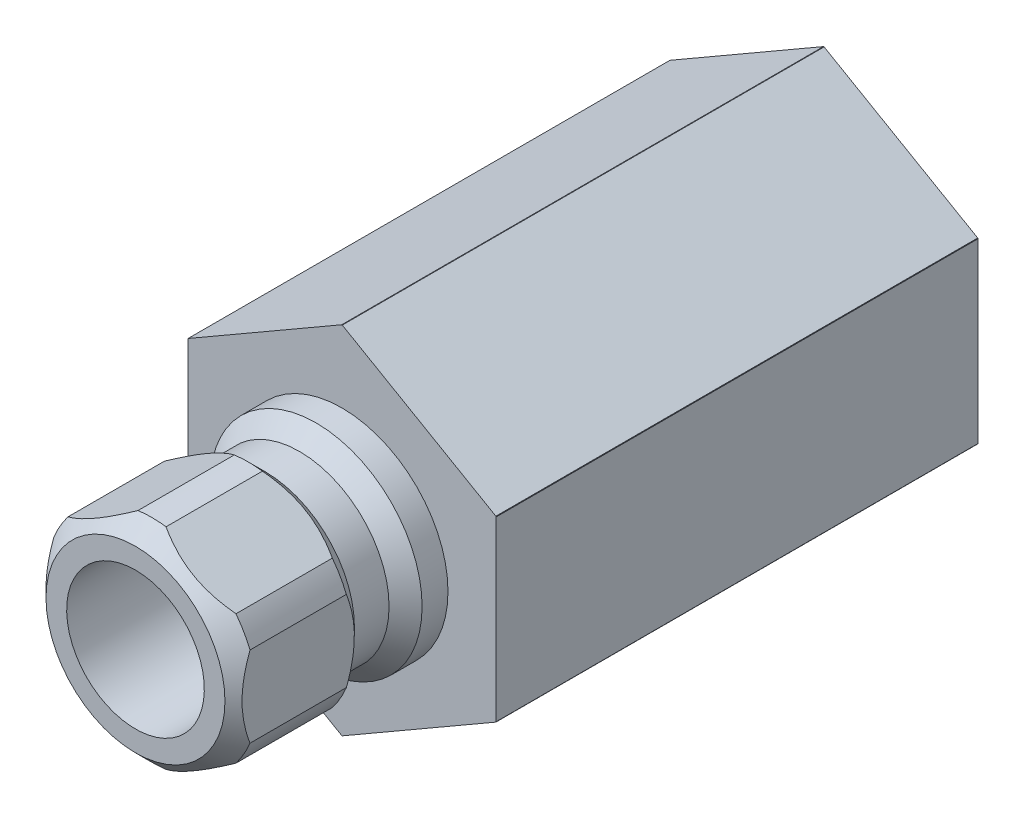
from build123d import *

# Parameters (mm, degrees)
SKETCH2_OUTSIDE_W  = 26.274
SKETCH2_OUTSIDE_H  = 26.274
SKETCH2_OUTSIDE_R  = 3.175
CUT_EXTRUDE1_DEPTH = 26.071266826
CUT_EXTRUDE2_START = 3.556
SKETCH3_OUTSIDE_W  = 23.918
SKETCH3_OUTSIDE_H  = 26.102
CUT_EXTRUDE2_DEPTH = 22.179401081


with BuildPart() as part:
    # Sketch1 → Revolve1 (revolve)
    with BuildSketch(Plane(origin=(0, 0, 0), x_dir=(0, 0, -1), z_dir=(1, 0, 0))):
        Polygon((-9.525, 3.175), (-9.525, 4.1275), (-8.763, 4.8895), (-4.318, 4.8895), (-3.556, 4.1275), (-1.9558, 4.1275), (-1.1938, 4.8895), (0, 4.8895), (0, 8.2042), (22.225, 8.2042), (22.225, 5.919388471), (10.6045, 5.55625), (10.6045, 3.175), align=None)
    revolve(axis=Axis((0, 0, 0), (0, 0, 1)))

    # Sketch2 outside → Cut-Extrude1 (cut, through all)
    # profile 1 of 2: a face of its own
    with BuildSketch(Plane.XY):
        Rectangle(SKETCH2_OUTSIDE_W, SKETCH2_OUTSIDE_H)
        Polygon((-7.112, 4.106115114), (-7.112, -4.106115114), (0, -8.212230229), (7.112, -4.106115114), (7.112, 4.106115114), (0, 8.212230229), align=None, mode=Mode.SUBTRACT)
    # profile 2 of 2: a face of its own
    with BuildSketch(Plane.XY):
        with Locations(Location((0, 0, 0), (0, 0, 90))):
            Circle(SKETCH2_OUTSIDE_R)
    extrude(amount=-CUT_EXTRUDE1_DEPTH, mode=Mode.SUBTRACT)

    # Sketch3 outside → Cut-Extrude2 (cut, through all)
    with BuildSketch(Plane.XY.offset(CUT_EXTRUDE2_START)):
        Rectangle(SKETCH3_OUTSIDE_W, SKETCH3_OUTSIDE_H)
        Polygon((-4.5212, 2.610316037), (-4.5212, -2.610316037), (0, -5.220632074), (4.5212, -2.610316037), (4.5212, 2.610316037), (0, 5.220632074), align=None, mode=Mode.SUBTRACT)
    extrude(amount=CUT_EXTRUDE2_DEPTH, mode=Mode.SUBTRACT)


solid = part.part
